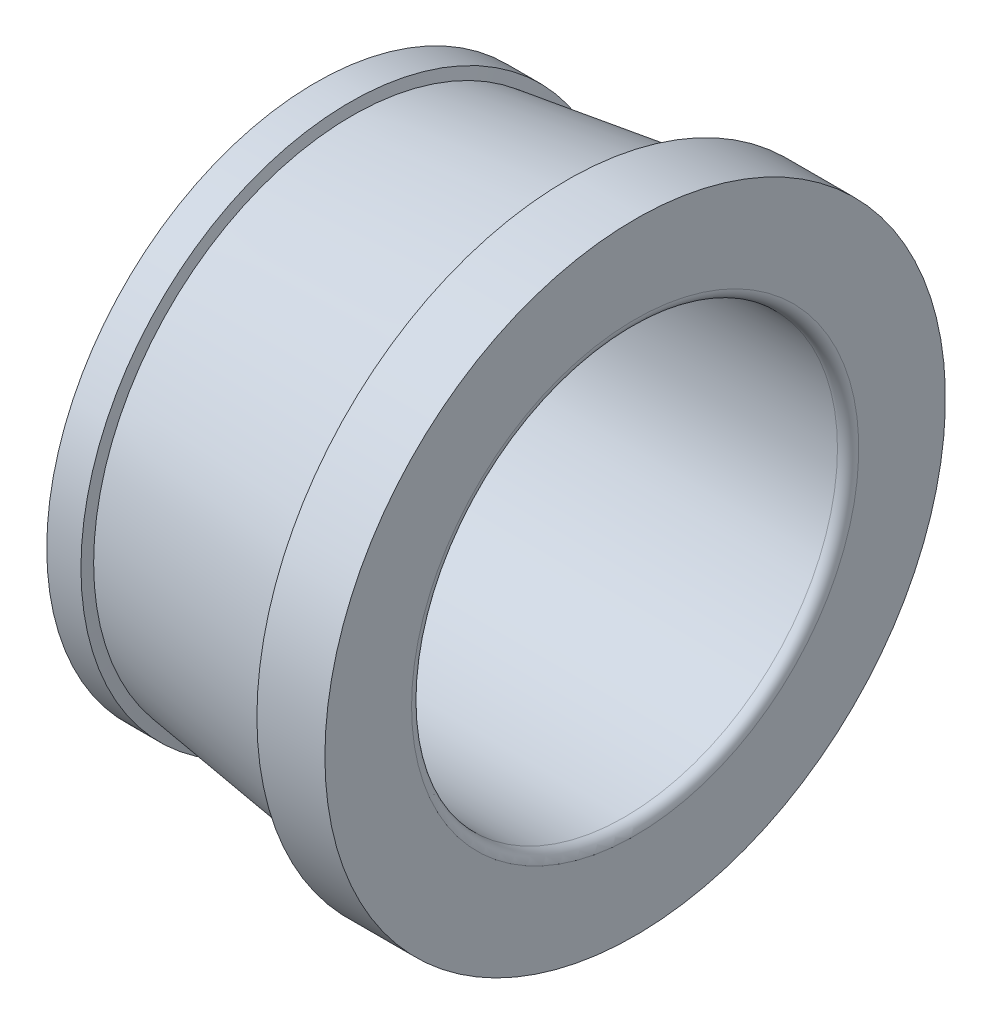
ISO-10303-21;
HEADER;
FILE_DESCRIPTION(('STEP AP214'),'2;1');
FILE_NAME('part.step','',(''),(''),'','','');
FILE_SCHEMA(('AUTOMOTIVE_DESIGN { 1 0 10303 214 1 1 1 1 }'));
ENDSEC;
DATA;
#1=APPLICATION_CONTEXT('core data for automotive mechanical design processes');
#2=APPLICATION_PROTOCOL_DEFINITION('international standard','automotive_design',2000,#1);
#3=PRODUCT_CONTEXT('',#1,'mechanical');
#4=PRODUCT('Part','Part','',(#3));
#5=PRODUCT_RELATED_PRODUCT_CATEGORY('part','',(#4));
#6=PRODUCT_DEFINITION_FORMATION('','',#4);
#7=PRODUCT_DEFINITION_CONTEXT('part definition',#1,'design');
#8=PRODUCT_DEFINITION('design','',#6,#7);
#9=PRODUCT_DEFINITION_SHAPE('','',#8);
#10=(LENGTH_UNIT() NAMED_UNIT(*) SI_UNIT(.MILLI.,.METRE.));
#11=(NAMED_UNIT(*) PLANE_ANGLE_UNIT() SI_UNIT($,.RADIAN.));
#12=(NAMED_UNIT(*) SI_UNIT($,.STERADIAN.) SOLID_ANGLE_UNIT());
#13=UNCERTAINTY_MEASURE_WITH_UNIT(LENGTH_MEASURE(1.E-05),#10,'distance_accuracy_value','');
#14=(GEOMETRIC_REPRESENTATION_CONTEXT(3) GLOBAL_UNCERTAINTY_ASSIGNED_CONTEXT((#13)) GLOBAL_UNIT_ASSIGNED_CONTEXT((#10,
#11,#12)) REPRESENTATION_CONTEXT('',''));
#15=CARTESIAN_POINT('',(0.,0.,0.));
#16=DIRECTION('',(0.,0.,1.));
#17=DIRECTION('',(1.,0.,0.));
#18=AXIS2_PLACEMENT_3D('',#15,#16,#17);
#19=CARTESIAN_POINT('',(0.500000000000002,0.,0.));
#20=DIRECTION('',(-1.,0.,0.));
#21=DIRECTION('',(0.,0.,1.));
#22=AXIS2_PLACEMENT_3D('',#19,#20,#21);
#23=TOROIDAL_SURFACE('',#22,10.5,0.500000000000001);
#24=CARTESIAN_POINT('',(0.500000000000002,0.,0.));
#25=DIRECTION('',(-1.,0.,0.));
#26=DIRECTION('',(0.,0.,1.));
#27=AXIS2_PLACEMENT_3D('',#24,#25,#26);
#28=CIRCLE('',#27,10.);
#29=CARTESIAN_POINT('',(0.500000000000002,0.,10.));
#30=VERTEX_POINT('',#29);
#31=EDGE_CURVE('E10',#30,#30,#28,.T.);
#32=ORIENTED_EDGE('',*,*,#31,.F.);
#33=EDGE_LOOP('',(#32));
#34=FACE_BOUND('',#33,.T.);
#35=CARTESIAN_POINT('',(0.,0.,0.));
#36=DIRECTION('',(-1.,0.,0.));
#37=DIRECTION('',(0.,0.,1.));
#38=AXIS2_PLACEMENT_3D('',#35,#36,#37);
#39=CIRCLE('',#38,10.5);
#40=CARTESIAN_POINT('',(0.,0.,10.5));
#41=VERTEX_POINT('',#40);
#42=EDGE_CURVE('E63',#41,#41,#39,.T.);
#43=ORIENTED_EDGE('',*,*,#42,.T.);
#44=EDGE_LOOP('',(#43));
#45=FACE_BOUND('',#44,.T.);
#46=ADVANCED_FACE('F29',(#34,#45),#23,.T.);
#47=CARTESIAN_POINT('',(0.,0.,0.));
#48=DIRECTION('',(-1.,0.,0.));
#49=DIRECTION('',(0.,0.,1.));
#50=AXIS2_PLACEMENT_3D('',#47,#48,#49);
#51=CYLINDRICAL_SURFACE('',#50,10.);
#52=CARTESIAN_POINT('',(14.5,0.,0.));
#53=DIRECTION('',(-1.,0.,0.));
#54=DIRECTION('',(0.,0.,1.));
#55=AXIS2_PLACEMENT_3D('',#52,#53,#54);
#56=CIRCLE('',#55,10.);
#57=CARTESIAN_POINT('',(14.5,0.,10.));
#58=VERTEX_POINT('',#57);
#59=EDGE_CURVE('E35',#58,#58,#56,.T.);
#60=ORIENTED_EDGE('',*,*,#59,.F.);
#61=EDGE_LOOP('',(#60));
#62=FACE_BOUND('',#61,.T.);
#63=ORIENTED_EDGE('',*,*,#31,.T.);
#64=EDGE_LOOP('',(#63));
#65=FACE_BOUND('',#64,.T.);
#66=ADVANCED_FACE('F112',(#62,#65),#51,.F.);
#67=CARTESIAN_POINT('',(14.5,0.,0.));
#68=DIRECTION('',(-1.,0.,0.));
#69=DIRECTION('',(0.,0.,1.));
#70=AXIS2_PLACEMENT_3D('',#67,#68,#69);
#71=TOROIDAL_SURFACE('',#70,10.5,0.5);
#72=CARTESIAN_POINT('',(15.,0.,0.));
#73=DIRECTION('',(-1.,0.,0.));
#74=DIRECTION('',(0.,0.,1.));
#75=AXIS2_PLACEMENT_3D('',#72,#73,#74);
#76=CIRCLE('',#75,10.5);
#77=CARTESIAN_POINT('',(15.,0.,10.5));
#78=VERTEX_POINT('',#77);
#79=EDGE_CURVE('E39',#78,#78,#76,.T.);
#80=ORIENTED_EDGE('',*,*,#79,.F.);
#81=EDGE_LOOP('',(#80));
#82=FACE_BOUND('',#81,.T.);
#83=ORIENTED_EDGE('',*,*,#59,.T.);
#84=EDGE_LOOP('',(#83));
#85=FACE_BOUND('',#84,.T.);
#86=ADVANCED_FACE('F107',(#82,#85),#71,.T.);
#87=CARTESIAN_POINT('',(15.,0.,-14.5699324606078));
#88=DIRECTION('',(-1.,0.,0.));
#89=DIRECTION('',(0.,0.,1.));
#90=AXIS2_PLACEMENT_3D('',#87,#88,#89);
#91=PLANE('',#90);
#92=CARTESIAN_POINT('',(15.,0.,0.));
#93=DIRECTION('',(-1.,0.,0.));
#94=DIRECTION('',(0.,0.,1.));
#95=AXIS2_PLACEMENT_3D('',#92,#93,#94);
#96=CIRCLE('',#95,14.5699324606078);
#97=CARTESIAN_POINT('',(15.,0.,14.5699324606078));
#98=VERTEX_POINT('',#97);
#99=EDGE_CURVE('E43',#98,#98,#96,.T.);
#100=ORIENTED_EDGE('',*,*,#99,.F.);
#101=EDGE_LOOP('',(#100));
#102=FACE_BOUND('',#101,.T.);
#103=ORIENTED_EDGE('',*,*,#79,.T.);
#104=EDGE_LOOP('',(#103));
#105=FACE_BOUND('',#104,.T.);
#106=ADVANCED_FACE('F101',(#102,#105),#91,.F.);
#107=CARTESIAN_POINT('',(0.,0.,0.));
#108=DIRECTION('',(-1.,0.,0.));
#109=DIRECTION('',(0.,0.,1.));
#110=AXIS2_PLACEMENT_3D('',#107,#108,#109);
#111=CYLINDRICAL_SURFACE('',#110,14.5699324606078);
#112=CARTESIAN_POINT('',(11.8064516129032,0.,0.));
#113=DIRECTION('',(-1.,0.,0.));
#114=DIRECTION('',(0.,0.,1.));
#115=AXIS2_PLACEMENT_3D('',#112,#113,#114);
#116=CIRCLE('',#115,14.5699324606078);
#117=CARTESIAN_POINT('',(11.8064516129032,0.,14.5699324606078));
#118=VERTEX_POINT('',#117);
#119=EDGE_CURVE('E48',#118,#118,#116,.T.);
#120=ORIENTED_EDGE('',*,*,#119,.F.);
#121=EDGE_LOOP('',(#120));
#122=FACE_BOUND('',#121,.T.);
#123=ORIENTED_EDGE('',*,*,#99,.T.);
#124=EDGE_LOOP('',(#123));
#125=FACE_BOUND('',#124,.T.);
#126=ADVANCED_FACE('F95',(#122,#125),#111,.T.);
#127=CARTESIAN_POINT('',(11.8064516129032,0.,0.));
#128=DIRECTION('',(-1.,0.,0.));
#129=DIRECTION('',(0.,0.,1.));
#130=AXIS2_PLACEMENT_3D('',#127,#128,#129);
#131=CONICAL_SURFACE('',#130,14.5699324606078,1.37961186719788);
#132=CARTESIAN_POINT('',(12.,0.,0.));
#133=DIRECTION('',(-1.,0.,0.));
#134=DIRECTION('',(0.,0.,1.));
#135=AXIS2_PLACEMENT_3D('',#132,#133,#134);
#136=CIRCLE('',#135,13.5699324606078);
#137=CARTESIAN_POINT('',(12.,0.,13.5699324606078));
#138=VERTEX_POINT('',#137);
#139=EDGE_CURVE('E51',#138,#138,#136,.T.);
#140=ORIENTED_EDGE('',*,*,#139,.F.);
#141=EDGE_LOOP('',(#140));
#142=FACE_BOUND('',#141,.T.);
#143=ORIENTED_EDGE('',*,*,#119,.T.);
#144=EDGE_LOOP('',(#143));
#145=FACE_BOUND('',#144,.T.);
#146=ADVANCED_FACE('F89',(#142,#145),#131,.F.);
#147=CARTESIAN_POINT('',(12.,0.,0.));
#148=DIRECTION('',(1.,0.,0.));
#149=DIRECTION('',(0.,0.,-1.));
#150=AXIS2_PLACEMENT_3D('',#147,#148,#149);
#151=CONICAL_SURFACE('',#150,13.5699324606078,0.138824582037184);
#152=CARTESIAN_POINT('',(1.70148800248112,0.,0.));
#153=DIRECTION('',(-1.,0.,0.));
#154=DIRECTION('',(0.,0.,1.));
#155=AXIS2_PLACEMENT_3D('',#152,#153,#154);
#156=CIRCLE('',#155,12.13099004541);
#157=CARTESIAN_POINT('',(1.70148800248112,0.,12.13099004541));
#158=VERTEX_POINT('',#157);
#159=EDGE_CURVE('E54',#158,#158,#156,.T.);
#160=ORIENTED_EDGE('',*,*,#159,.F.);
#161=EDGE_LOOP('',(#160));
#162=FACE_BOUND('',#161,.T.);
#163=ORIENTED_EDGE('',*,*,#139,.T.);
#164=EDGE_LOOP('',(#163));
#165=FACE_BOUND('',#164,.T.);
#166=ADVANCED_FACE('F83',(#162,#165),#151,.T.);
#167=CARTESIAN_POINT('',(1.70148800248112,0.,0.));
#168=DIRECTION('',(-1.,0.,0.));
#169=DIRECTION('',(0.,0.,1.));
#170=AXIS2_PLACEMENT_3D('',#167,#168,#169);
#171=CONICAL_SURFACE('',#170,12.13099004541,1.37961186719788);
#172=CARTESIAN_POINT('',(1.60471380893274,0.,0.));
#173=DIRECTION('',(-1.,0.,0.));
#174=DIRECTION('',(0.,0.,1.));
#175=AXIS2_PLACEMENT_3D('',#172,#173,#174);
#176=CIRCLE('',#175,12.63099004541);
#177=CARTESIAN_POINT('',(1.60471380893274,0.,12.63099004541));
#178=VERTEX_POINT('',#177);
#179=EDGE_CURVE('E57',#178,#178,#176,.T.);
#180=ORIENTED_EDGE('',*,*,#179,.F.);
#181=EDGE_LOOP('',(#180));
#182=FACE_BOUND('',#181,.T.);
#183=ORIENTED_EDGE('',*,*,#159,.T.);
#184=EDGE_LOOP('',(#183));
#185=FACE_BOUND('',#184,.T.);
#186=ADVANCED_FACE('F77',(#182,#185),#171,.T.);
#187=CARTESIAN_POINT('',(0.,0.,0.));
#188=DIRECTION('',(-1.,0.,0.));
#189=DIRECTION('',(0.,0.,1.));
#190=AXIS2_PLACEMENT_3D('',#187,#188,#189);
#191=CYLINDRICAL_SURFACE('',#190,12.63099004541);
#192=CARTESIAN_POINT('',(0.,0.,0.));
#193=DIRECTION('',(-1.,0.,0.));
#194=DIRECTION('',(0.,0.,1.));
#195=AXIS2_PLACEMENT_3D('',#192,#193,#194);
#196=CIRCLE('',#195,12.63099004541);
#197=CARTESIAN_POINT('',(0.,0.,12.63099004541));
#198=VERTEX_POINT('',#197);
#199=EDGE_CURVE('E60',#198,#198,#196,.T.);
#200=ORIENTED_EDGE('',*,*,#199,.F.);
#201=EDGE_LOOP('',(#200));
#202=FACE_BOUND('',#201,.T.);
#203=ORIENTED_EDGE('',*,*,#179,.T.);
#204=EDGE_LOOP('',(#203));
#205=FACE_BOUND('',#204,.T.);
#206=ADVANCED_FACE('F71',(#202,#205),#191,.T.);
#207=CARTESIAN_POINT('',(0.,0.,-10.5));
#208=DIRECTION('',(1.,0.,0.));
#209=DIRECTION('',(0.,0.,-1.));
#210=AXIS2_PLACEMENT_3D('',#207,#208,#209);
#211=PLANE('',#210);
#212=ORIENTED_EDGE('',*,*,#42,.F.);
#213=EDGE_LOOP('',(#212));
#214=FACE_BOUND('',#213,.T.);
#215=ORIENTED_EDGE('',*,*,#199,.T.);
#216=EDGE_LOOP('',(#215));
#217=FACE_BOUND('',#216,.T.);
#218=ADVANCED_FACE('F68',(#214,#217),#211,.F.);
#219=CLOSED_SHELL('',(#46,#66,#86,#106,#126,#146,#166,#186,#206,#218));
#220=MANIFOLD_SOLID_BREP('B2',#219);
#221=ADVANCED_BREP_SHAPE_REPRESENTATION('',(#18,#220),#14);
#222=SHAPE_DEFINITION_REPRESENTATION(#9,#221);
ENDSEC;
END-ISO-10303-21;
